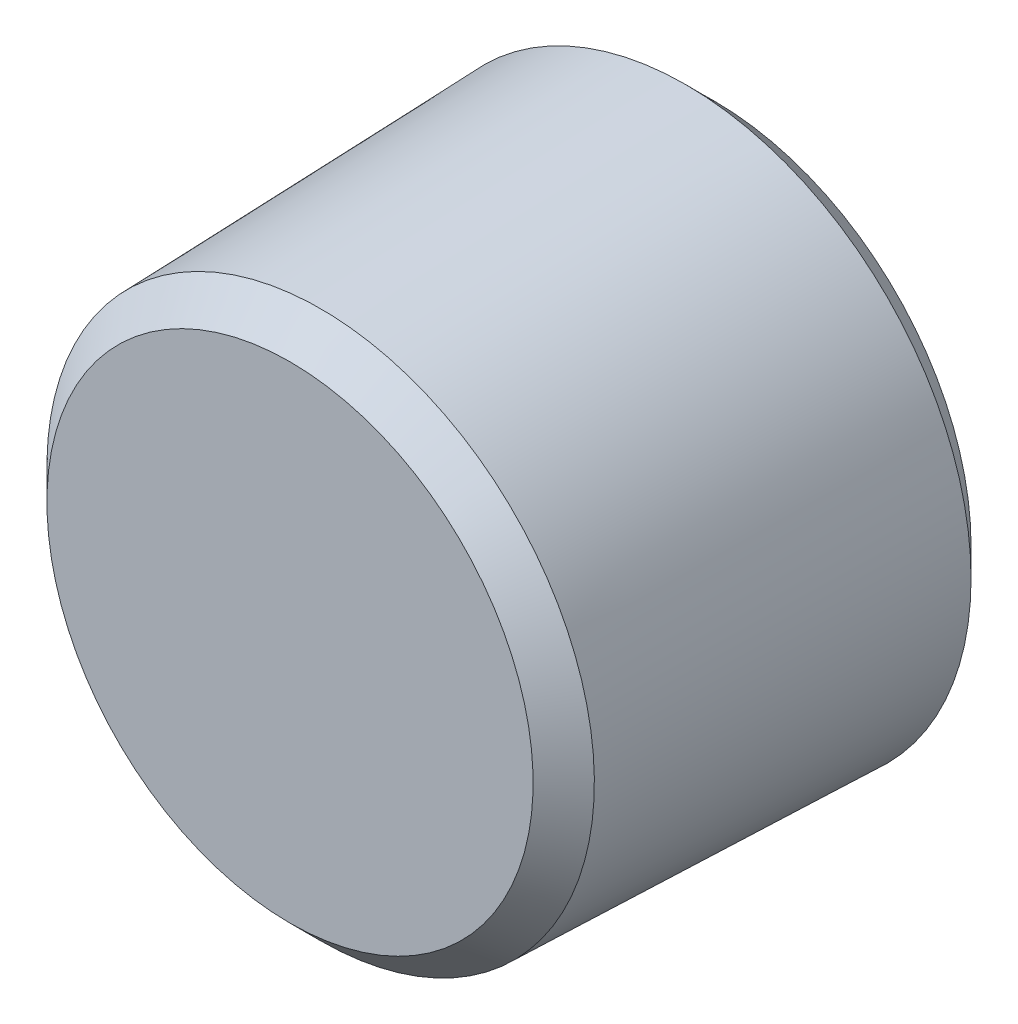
from build123d import *

# Parameters (mm, degrees)
CUT_EXTRUDE1_DEPTH = 7.000001


with BuildPart() as part:
    # Sketch1 → Revolve1 (revolve)
    with BuildSketch(Plane(origin=(0, 0, 0), x_dir=(0, 0, -1), z_dir=(1, 0, 0)), mode=Mode.PRIVATE) as revolve1_sk:
        Polygon((-9.103012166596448, 5e-17), (-10, 0), (-10, 5.725), (-9.278777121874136, 6.446222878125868), (-0.6774916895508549, 6.715144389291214), (0, 6.037652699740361), (-0.6249999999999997, 6.01811190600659), (-1.2499999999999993, 5.998571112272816), (-1.8749999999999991, 5.979030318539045), (-2.4999999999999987, 5.959489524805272), (-3.1250000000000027, 5.9399487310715), (-3.7500000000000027, 5.9204079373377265), (-4.375000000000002, 5.900867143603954), (-4.999999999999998, 5.88132634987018), (-5.625, 5.861785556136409), (-6.25, 5.842244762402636), (-6.874999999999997, 5.822703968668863), (-7.5, 5.803163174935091), (-8.125, 5.783622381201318), (-8.749999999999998, 5.764081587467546), (-9.375, 5.744540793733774), (-9.990000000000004, 5.725312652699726), (-9.990000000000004, 5.715307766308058), (-9e-17, 6.02764781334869), (0, 3.5), (-7, 3.500000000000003), align=None)
    revolve(revolve1_sk.sketch.rotate(Axis((0, 0, 10), (0, 7e-17, -1)), 180), axis=Axis((0, 0, 10), (0, 7e-17, -1)))

    # Sketch2 → Cut-Extrude1 (cut)
    with BuildSketch(Plane.XY):
        Polygon((2.0207259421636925, -3.500000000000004), (4.041451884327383, -5.4e-16), (2.020725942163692, 3.500000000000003), (-2.020725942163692, 3.500000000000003), (-4.041451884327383, -5.4e-16), (-2.0207259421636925, -3.500000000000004), align=None)
    extrude(amount=CUT_EXTRUDE1_DEPTH, mode=Mode.SUBTRACT)


solid = part.part
